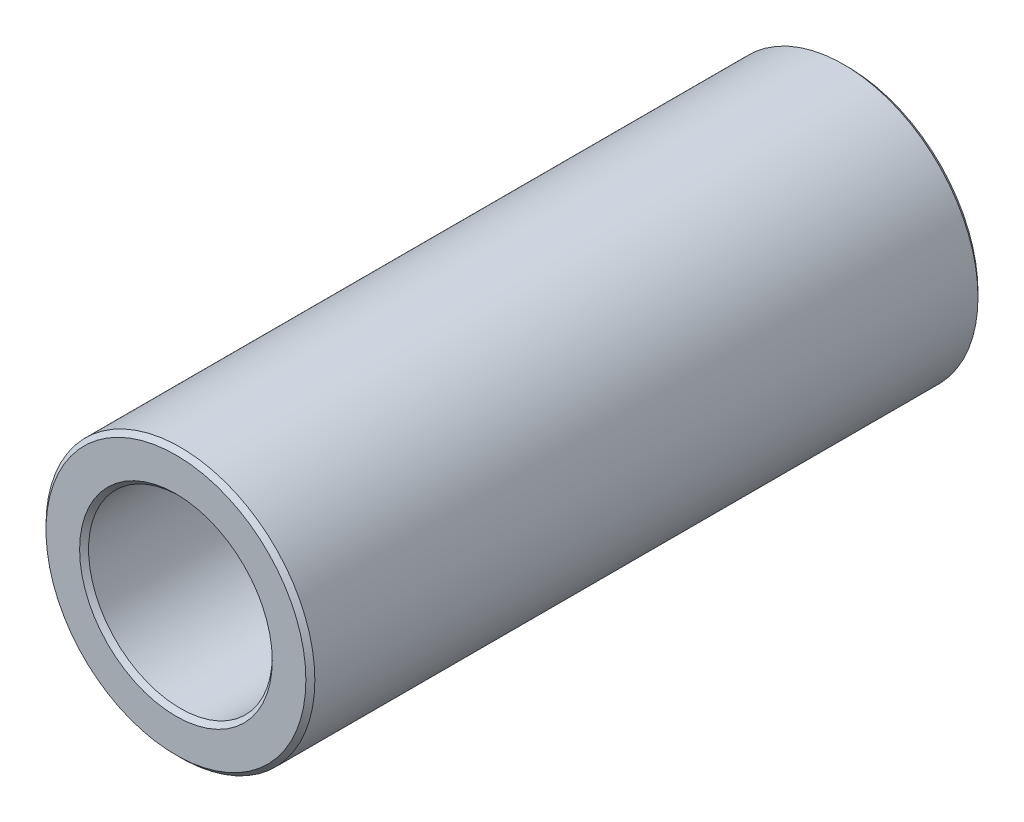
from build123d import *

# Parameters (mm, degrees)
SKETCH1_R           = 6
SKETCH1_R_2         = 4.1
BOSS_EXTRUDE2_DEPTH = 15
CHAMFER3_SIZE       = 0.2


with BuildPart() as part:
    # Sketch1 → Boss-Extrude2 (new, symmetric)
    with BuildSketch(Plane.XY):
        Circle(SKETCH1_R)
        Circle(SKETCH1_R_2, mode=Mode.SUBTRACT)
    extrude(amount=BOSS_EXTRUDE2_DEPTH, both=True)

    # Chamfer3
    chamfer3_edges = [part.edges().sort_by_distance(p)[0] for p in [
        (-6, 0, -15),
        (-6, 0, 15),
        (-4.1, 0, -15),
        (-4.1, 0, 15),
    ]]
    chamfer(chamfer3_edges, length=CHAMFER3_SIZE)


solid = part.part
